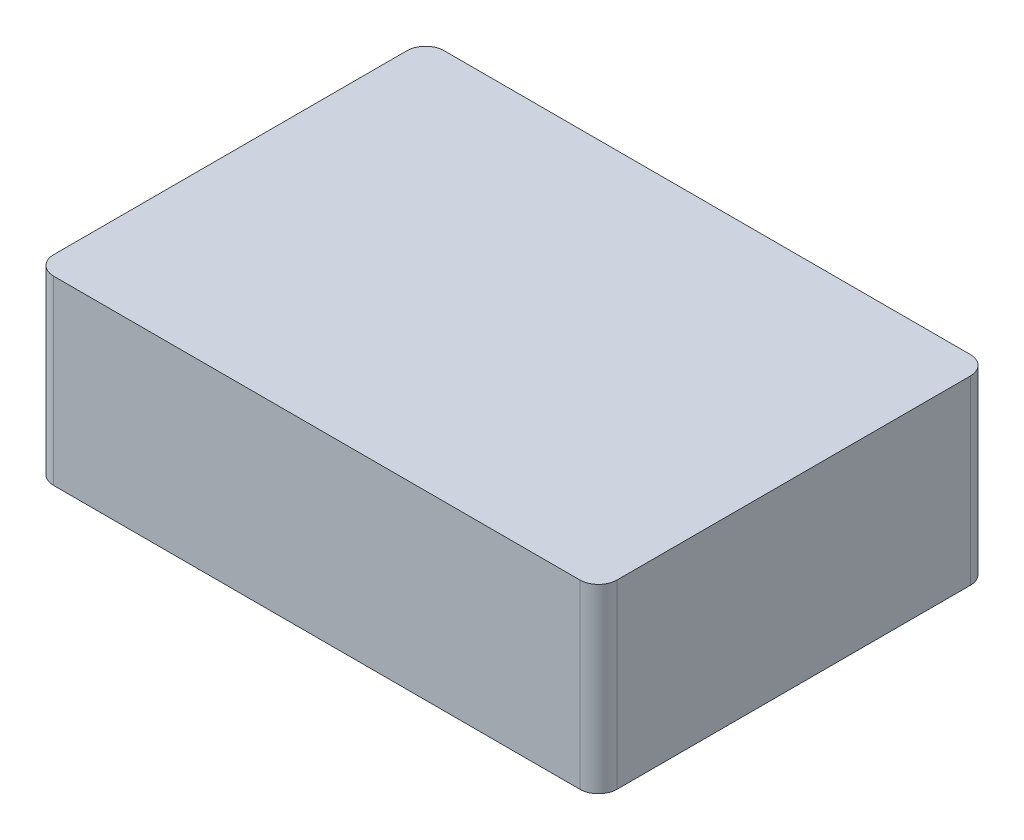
ISO-10303-21;
HEADER;
FILE_DESCRIPTION(('STEP AP214'),'2;1');
FILE_NAME('part.step','',(''),(''),'','','');
FILE_SCHEMA(('AUTOMOTIVE_DESIGN { 1 0 10303 214 1 1 1 1 }'));
ENDSEC;
DATA;
#1=APPLICATION_CONTEXT('core data for automotive mechanical design processes');
#2=APPLICATION_PROTOCOL_DEFINITION('international standard','automotive_design',2000,#1);
#3=PRODUCT_CONTEXT('',#1,'mechanical');
#4=PRODUCT('Part','Part','',(#3));
#5=PRODUCT_RELATED_PRODUCT_CATEGORY('part','',(#4));
#6=PRODUCT_DEFINITION_FORMATION('','',#4);
#7=PRODUCT_DEFINITION_CONTEXT('part definition',#1,'design');
#8=PRODUCT_DEFINITION('design','',#6,#7);
#9=PRODUCT_DEFINITION_SHAPE('','',#8);
#10=(LENGTH_UNIT() NAMED_UNIT(*) SI_UNIT(.MILLI.,.METRE.));
#11=(NAMED_UNIT(*) PLANE_ANGLE_UNIT() SI_UNIT($,.RADIAN.));
#12=(NAMED_UNIT(*) SI_UNIT($,.STERADIAN.) SOLID_ANGLE_UNIT());
#13=UNCERTAINTY_MEASURE_WITH_UNIT(LENGTH_MEASURE(1.E-05),#10,'distance_accuracy_value','');
#14=(GEOMETRIC_REPRESENTATION_CONTEXT(3) GLOBAL_UNCERTAINTY_ASSIGNED_CONTEXT((#13)) GLOBAL_UNIT_ASSIGNED_CONTEXT((#10,
#11,#12)) REPRESENTATION_CONTEXT('',''));
#15=CARTESIAN_POINT('',(0.,0.,0.));
#16=DIRECTION('',(0.,0.,1.));
#17=DIRECTION('',(1.,0.,0.));
#18=AXIS2_PLACEMENT_3D('',#15,#16,#17);
#19=CARTESIAN_POINT('',(38.481,122.214228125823,22.86));
#20=DIRECTION('',(0.,0.,-1.));
#21=DIRECTION('',(-1.,0.,0.));
#22=AXIS2_PLACEMENT_3D('',#19,#20,#21);
#23=PLANE('',#22);
#24=DIRECTION('',(0.,-1.,0.));
#25=VECTOR('',#24,1.);
#26=CARTESIAN_POINT('',(-27.8539034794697,29.9352561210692,22.86));
#27=LINE('',#26,#25);
#28=CARTESIAN_POINT('',(-27.8539034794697,20.955,22.86));
#29=VERTEX_POINT('',#28);
#30=CARTESIAN_POINT('',(-27.8539034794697,0.,22.86));
#31=VERTEX_POINT('',#30);
#32=EDGE_CURVE('E220',#29,#31,#27,.T.);
#33=ORIENTED_EDGE('',*,*,#32,.F.);
#34=DIRECTION('',(-1.,0.,0.));
#35=VECTOR('',#34,1.);
#36=CARTESIAN_POINT('',(38.481,20.955,22.86));
#37=LINE('',#36,#35);
#38=CARTESIAN_POINT('',(27.8539034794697,20.955,22.86));
#39=VERTEX_POINT('',#38);
#40=EDGE_CURVE('E275',#39,#29,#37,.T.);
#41=ORIENTED_EDGE('',*,*,#40,.F.);
#42=DIRECTION('',(0.,-1.,0.));
#43=VECTOR('',#42,1.);
#44=CARTESIAN_POINT('',(27.8539034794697,29.9352561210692,22.86));
#45=LINE('',#44,#43);
#46=CARTESIAN_POINT('',(27.8539034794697,0.,22.86));
#47=VERTEX_POINT('',#46);
#48=EDGE_CURVE('E236',#47,#39,#45,.F.);
#49=ORIENTED_EDGE('',*,*,#48,.F.);
#50=DIRECTION('',(1.,0.,0.));
#51=VECTOR('',#50,1.);
#52=CARTESIAN_POINT('',(38.481,0.,22.86));
#53=LINE('',#52,#51);
#54=EDGE_CURVE('E48',#31,#47,#53,.T.);
#55=ORIENTED_EDGE('',*,*,#54,.F.);
#56=EDGE_LOOP('',(#33,#41,#49,#55));
#57=FACE_BOUND('',#56,.T.);
#58=ADVANCED_FACE('F33',(#57),#23,.T.);
#59=CARTESIAN_POINT('',(38.481,122.214228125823,-22.86));
#60=DIRECTION('',(0.,0.,1.));
#61=DIRECTION('',(1.,0.,0.));
#62=AXIS2_PLACEMENT_3D('',#59,#60,#61);
#63=PLANE('',#62);
#64=DIRECTION('',(0.,-1.,0.));
#65=VECTOR('',#64,1.);
#66=CARTESIAN_POINT('',(-34.1220965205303,29.9352561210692,-22.86));
#67=LINE('',#66,#65);
#68=CARTESIAN_POINT('',(-34.1220965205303,20.955,-22.86));
#69=VERTEX_POINT('',#68);
#70=CARTESIAN_POINT('',(-34.1220965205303,0.,-22.86));
#71=VERTEX_POINT('',#70);
#72=EDGE_CURVE('E230',#69,#71,#67,.T.);
#73=ORIENTED_EDGE('',*,*,#72,.F.);
#74=DIRECTION('',(1.,0.,0.));
#75=VECTOR('',#74,1.);
#76=CARTESIAN_POINT('',(38.481,20.955,-22.86));
#77=LINE('',#76,#75);
#78=CARTESIAN_POINT('',(-34.671,20.955,-22.86));
#79=VERTEX_POINT('',#78);
#80=EDGE_CURVE('E259',#79,#69,#77,.T.);
#81=ORIENTED_EDGE('',*,*,#80,.F.);
#82=DIRECTION('',(0.,1.,0.));
#83=VECTOR('',#82,1.);
#84=CARTESIAN_POINT('',(-34.671,122.214228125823,-22.86));
#85=LINE('',#84,#83);
#86=CARTESIAN_POINT('',(-34.671,0.,-22.86));
#87=VERTEX_POINT('',#86);
#88=EDGE_CURVE('E254',#87,#79,#85,.T.);
#89=ORIENTED_EDGE('',*,*,#88,.F.);
#90=DIRECTION('',(-1.,0.,0.));
#91=VECTOR('',#90,1.);
#92=CARTESIAN_POINT('',(38.481,0.,-22.86));
#93=LINE('',#92,#91);
#94=EDGE_CURVE('E283',#71,#87,#93,.T.);
#95=ORIENTED_EDGE('',*,*,#94,.F.);
#96=EDGE_LOOP('',(#73,#81,#89,#95));
#97=FACE_BOUND('',#96,.T.);
#98=ADVANCED_FACE('F368',(#97),#63,.T.);
#99=DIRECTION('',(0.,-1.,0.));
#100=VECTOR('',#99,1.);
#101=CARTESIAN_POINT('',(34.1220965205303,29.9352561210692,22.86));
#102=LINE('',#101,#100);
#103=CARTESIAN_POINT('',(34.1220965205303,20.955,22.86));
#104=VERTEX_POINT('',#103);
#105=CARTESIAN_POINT('',(34.1220965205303,0.,22.86));
#106=VERTEX_POINT('',#105);
#107=EDGE_CURVE('E239',#104,#106,#102,.T.);
#108=ORIENTED_EDGE('',*,*,#107,.F.);
#109=CARTESIAN_POINT('',(34.671,20.955,22.86));
#110=VERTEX_POINT('',#109);
#111=EDGE_CURVE('E273',#110,#104,#37,.T.);
#112=ORIENTED_EDGE('',*,*,#111,.F.);
#113=DIRECTION('',(0.,1.,0.));
#114=VECTOR('',#113,1.);
#115=CARTESIAN_POINT('',(34.671,122.214228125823,22.86));
#116=LINE('',#115,#114);
#117=CARTESIAN_POINT('',(34.671,0.,22.86));
#118=VERTEX_POINT('',#117);
#119=EDGE_CURVE('E269',#118,#110,#116,.T.);
#120=ORIENTED_EDGE('',*,*,#119,.F.);
#121=EDGE_CURVE('E289',#106,#118,#53,.T.);
#122=ORIENTED_EDGE('',*,*,#121,.F.);
#123=EDGE_LOOP('',(#108,#112,#120,#122));
#124=FACE_BOUND('',#123,.T.);
#125=ADVANCED_FACE('F395',(#124),#23,.T.);
#126=DIRECTION('',(0.,-1.,0.));
#127=VECTOR('',#126,1.);
#128=CARTESIAN_POINT('',(-27.8539034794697,29.9352561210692,-22.86));
#129=LINE('',#128,#127);
#130=CARTESIAN_POINT('',(-27.8539034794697,0.,-22.86));
#131=VERTEX_POINT('',#130);
#132=CARTESIAN_POINT('',(-27.8539034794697,20.955,-22.86));
#133=VERTEX_POINT('',#132);
#134=EDGE_CURVE('E227',#131,#133,#129,.F.);
#135=ORIENTED_EDGE('',*,*,#134,.F.);
#136=CARTESIAN_POINT('',(27.8539034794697,0.,-22.86));
#137=VERTEX_POINT('',#136);
#138=EDGE_CURVE('E282',#137,#131,#93,.T.);
#139=ORIENTED_EDGE('',*,*,#138,.F.);
#140=DIRECTION('',(0.,-1.,0.));
#141=VECTOR('',#140,1.);
#142=CARTESIAN_POINT('',(27.8539034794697,29.9352561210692,-22.86));
#143=LINE('',#142,#141);
#144=CARTESIAN_POINT('',(27.8539034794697,20.955,-22.86));
#145=VERTEX_POINT('',#144);
#146=EDGE_CURVE('E250',#145,#137,#143,.T.);
#147=ORIENTED_EDGE('',*,*,#146,.F.);
#148=EDGE_CURVE('E262',#133,#145,#77,.T.);
#149=ORIENTED_EDGE('',*,*,#148,.F.);
#150=EDGE_LOOP('',(#135,#139,#147,#149));
#151=FACE_BOUND('',#150,.T.);
#152=ADVANCED_FACE('F374',(#151),#63,.T.);
#153=CARTESIAN_POINT('',(0.,0.,0.));
#154=DIRECTION('',(0.,1.,0.));
#155=DIRECTION('',(0.,0.,1.));
#156=AXIS2_PLACEMENT_3D('',#153,#154,#155);
#157=PLANE('',#156);
#158=CARTESIAN_POINT('',(-30.988,0.,22.352));
#159=DIRECTION('',(0.,-1.,0.));
#160=DIRECTION('',(0.,0.,-1.));
#161=AXIS2_PLACEMENT_3D('',#158,#159,#160);
#162=CIRCLE('',#161,1.4732);
#163=CARTESIAN_POINT('',(-30.988,0.,20.8788));
#164=VERTEX_POINT('',#163);
#165=EDGE_CURVE('E194',#164,#164,#162,.T.);
#166=ORIENTED_EDGE('',*,*,#165,.F.);
#167=EDGE_LOOP('',(#166));
#168=FACE_BOUND('',#167,.T.);
#169=CARTESIAN_POINT('',(30.988,0.,22.352));
#170=DIRECTION('',(0.,-1.,0.));
#171=DIRECTION('',(0.,0.,-1.));
#172=AXIS2_PLACEMENT_3D('',#169,#170,#171);
#173=CIRCLE('',#172,1.4732);
#174=CARTESIAN_POINT('',(30.988,0.,20.8788));
#175=VERTEX_POINT('',#174);
#176=EDGE_CURVE('E193',#175,#175,#173,.T.);
#177=ORIENTED_EDGE('',*,*,#176,.F.);
#178=EDGE_LOOP('',(#177));
#179=FACE_BOUND('',#178,.T.);
#180=CARTESIAN_POINT('',(-30.988,0.,-22.352));
#181=DIRECTION('',(0.,-1.,0.));
#182=DIRECTION('',(0.,0.,-1.));
#183=AXIS2_PLACEMENT_3D('',#180,#181,#182);
#184=CIRCLE('',#183,1.4732);
#185=CARTESIAN_POINT('',(-30.988,0.,-23.8252));
#186=VERTEX_POINT('',#185);
#187=EDGE_CURVE('E204',#186,#186,#184,.T.);
#188=ORIENTED_EDGE('',*,*,#187,.F.);
#189=EDGE_LOOP('',(#188));
#190=FACE_BOUND('',#189,.T.);
#191=CARTESIAN_POINT('',(30.988,0.,-22.352));
#192=DIRECTION('',(0.,-1.,0.));
#193=DIRECTION('',(0.,0.,-1.));
#194=AXIS2_PLACEMENT_3D('',#191,#192,#193);
#195=CIRCLE('',#194,1.4732);
#196=CARTESIAN_POINT('',(30.988,0.,-23.8252));
#197=VERTEX_POINT('',#196);
#198=EDGE_CURVE('E210',#197,#197,#195,.T.);
#199=ORIENTED_EDGE('',*,*,#198,.F.);
#200=EDGE_LOOP('',(#199));
#201=FACE_BOUND('',#200,.T.);
#202=CARTESIAN_POINT('',(-34.671,0.,22.86));
#203=VERTEX_POINT('',#202);
#204=CARTESIAN_POINT('',(-34.1220965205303,0.,22.86));
#205=VERTEX_POINT('',#204);
#206=EDGE_CURVE('E287',#203,#205,#53,.T.);
#207=ORIENTED_EDGE('',*,*,#206,.T.);
#208=CARTESIAN_POINT('',(-30.988,0.,22.352));
#209=DIRECTION('',(0.,-1.,0.));
#210=DIRECTION('',(0.,0.,-1.));
#211=AXIS2_PLACEMENT_3D('',#208,#209,#210);
#212=CIRCLE('',#211,3.175);
#213=EDGE_CURVE('E216',#205,#31,#212,.T.);
#214=ORIENTED_EDGE('',*,*,#213,.T.);
#215=ORIENTED_EDGE('',*,*,#54,.T.);
#216=CARTESIAN_POINT('',(30.988,0.,22.352));
#217=DIRECTION('',(0.,-1.,0.));
#218=DIRECTION('',(0.,0.,-1.));
#219=AXIS2_PLACEMENT_3D('',#216,#217,#218);
#220=CIRCLE('',#219,3.175);
#221=EDGE_CURVE('E233',#47,#106,#220,.T.);
#222=ORIENTED_EDGE('',*,*,#221,.T.);
#223=ORIENTED_EDGE('',*,*,#121,.T.);
#224=DIRECTION('',(0.,0.,-1.));
#225=VECTOR('',#224,1.);
#226=CARTESIAN_POINT('',(34.671,0.,26.67));
#227=LINE('',#226,#225);
#228=CARTESIAN_POINT('',(34.671,0.,-22.86));
#229=VERTEX_POINT('',#228);
#230=EDGE_CURVE('E284',#118,#229,#227,.T.);
#231=ORIENTED_EDGE('',*,*,#230,.T.);
#232=CARTESIAN_POINT('',(34.1220965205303,0.,-22.86));
#233=VERTEX_POINT('',#232);
#234=EDGE_CURVE('E279',#229,#233,#93,.T.);
#235=ORIENTED_EDGE('',*,*,#234,.T.);
#236=CARTESIAN_POINT('',(30.988,0.,-22.352));
#237=DIRECTION('',(0.,-1.,0.));
#238=DIRECTION('',(0.,0.,-1.));
#239=AXIS2_PLACEMENT_3D('',#236,#237,#238);
#240=CIRCLE('',#239,3.175);
#241=EDGE_CURVE('E242',#233,#137,#240,.T.);
#242=ORIENTED_EDGE('',*,*,#241,.T.);
#243=ORIENTED_EDGE('',*,*,#138,.T.);
#244=CARTESIAN_POINT('',(-30.988,0.,-22.352));
#245=DIRECTION('',(0.,-1.,0.));
#246=DIRECTION('',(0.,0.,-1.));
#247=AXIS2_PLACEMENT_3D('',#244,#245,#246);
#248=CIRCLE('',#247,3.175);
#249=EDGE_CURVE('E222',#131,#71,#248,.T.);
#250=ORIENTED_EDGE('',*,*,#249,.T.);
#251=ORIENTED_EDGE('',*,*,#94,.T.);
#252=DIRECTION('',(0.,0.,1.));
#253=VECTOR('',#252,1.);
#254=CARTESIAN_POINT('',(-34.671,0.,26.67));
#255=LINE('',#254,#253);
#256=EDGE_CURVE('E253',#87,#203,#255,.T.);
#257=ORIENTED_EDGE('',*,*,#256,.T.);
#258=EDGE_LOOP('',(#207,#214,#215,#222,#223,#231,#235,#242,#243,#250,#251,#257));
#259=FACE_BOUND('',#258,.T.);
#260=DIRECTION('',(1.,0.,0.));
#261=VECTOR('',#260,1.);
#262=CARTESIAN_POINT('',(38.481,0.,26.67));
#263=LINE('',#262,#261);
#264=CARTESIAN_POINT('',(-35.941,0.,26.67));
#265=VERTEX_POINT('',#264);
#266=CARTESIAN_POINT('',(35.941,0.,26.67));
#267=VERTEX_POINT('',#266);
#268=EDGE_CURVE('E305',#265,#267,#263,.T.);
#269=ORIENTED_EDGE('',*,*,#268,.F.);
#270=CARTESIAN_POINT('',(-35.941,0.,24.13));
#271=DIRECTION('',(0.,1.,0.));
#272=DIRECTION('',(0.,0.,1.));
#273=AXIS2_PLACEMENT_3D('',#270,#271,#272);
#274=CIRCLE('',#273,2.54);
#275=CARTESIAN_POINT('',(-38.481,0.,24.13));
#276=VERTEX_POINT('',#275);
#277=EDGE_CURVE('E326',#265,#276,#274,.F.);
#278=ORIENTED_EDGE('',*,*,#277,.T.);
#279=DIRECTION('',(0.,0.,1.));
#280=VECTOR('',#279,1.);
#281=CARTESIAN_POINT('',(-38.481,0.,26.67));
#282=LINE('',#281,#280);
#283=CARTESIAN_POINT('',(-38.481,0.,-24.13));
#284=VERTEX_POINT('',#283);
#285=EDGE_CURVE('E266',#284,#276,#282,.T.);
#286=ORIENTED_EDGE('',*,*,#285,.F.);
#287=CARTESIAN_POINT('',(-35.941,0.,-24.13));
#288=DIRECTION('',(0.,1.,0.));
#289=DIRECTION('',(0.,0.,1.));
#290=AXIS2_PLACEMENT_3D('',#287,#288,#289);
#291=CIRCLE('',#290,2.54);
#292=CARTESIAN_POINT('',(-35.941,0.,-26.67));
#293=VERTEX_POINT('',#292);
#294=EDGE_CURVE('E324',#284,#293,#291,.F.);
#295=ORIENTED_EDGE('',*,*,#294,.T.);
#296=DIRECTION('',(-1.,0.,0.));
#297=VECTOR('',#296,1.);
#298=CARTESIAN_POINT('',(38.481,0.,-26.67));
#299=LINE('',#298,#297);
#300=CARTESIAN_POINT('',(35.941,0.,-26.67));
#301=VERTEX_POINT('',#300);
#302=EDGE_CURVE('E311',#301,#293,#299,.T.);
#303=ORIENTED_EDGE('',*,*,#302,.F.);
#304=CARTESIAN_POINT('',(35.941,0.,-24.13));
#305=DIRECTION('',(0.,1.,0.));
#306=DIRECTION('',(0.,0.,1.));
#307=AXIS2_PLACEMENT_3D('',#304,#305,#306);
#308=CIRCLE('',#307,2.54);
#309=CARTESIAN_POINT('',(38.481,0.,-24.13));
#310=VERTEX_POINT('',#309);
#311=EDGE_CURVE('E322',#301,#310,#308,.F.);
#312=ORIENTED_EDGE('',*,*,#311,.T.);
#313=DIRECTION('',(0.,0.,-1.));
#314=VECTOR('',#313,1.);
#315=CARTESIAN_POINT('',(38.481,0.,26.67));
#316=LINE('',#315,#314);
#317=CARTESIAN_POINT('',(38.481,0.,24.13));
#318=VERTEX_POINT('',#317);
#319=EDGE_CURVE('E308',#318,#310,#316,.T.);
#320=ORIENTED_EDGE('',*,*,#319,.F.);
#321=CARTESIAN_POINT('',(35.941,0.,24.13));
#322=DIRECTION('',(0.,1.,0.));
#323=DIRECTION('',(0.,0.,1.));
#324=AXIS2_PLACEMENT_3D('',#321,#322,#323);
#325=CIRCLE('',#324,2.54);
#326=EDGE_CURVE('E320',#318,#267,#325,.F.);
#327=ORIENTED_EDGE('',*,*,#326,.T.);
#328=EDGE_LOOP('',(#269,#278,#286,#295,#303,#312,#320,#327));
#329=FACE_BOUND('',#328,.T.);
#330=ADVANCED_FACE('F380',(#168,#179,#190,#201,#259,#329),#157,.F.);
#331=CARTESIAN_POINT('',(38.481,122.214228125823,-26.67));
#332=DIRECTION('',(0.,0.,1.));
#333=DIRECTION('',(1.,0.,0.));
#334=AXIS2_PLACEMENT_3D('',#331,#332,#333);
#335=PLANE('',#334);
#336=ORIENTED_EDGE('',*,*,#302,.T.);
#337=DIRECTION('',(0.,-1.,0.));
#338=VECTOR('',#337,1.);
#339=CARTESIAN_POINT('',(-35.941,122.214228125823,-26.67));
#340=LINE('',#339,#338);
#341=CARTESIAN_POINT('',(-35.941,24.765,-26.67));
#342=VERTEX_POINT('',#341);
#343=EDGE_CURVE('E344',#293,#342,#340,.F.);
#344=ORIENTED_EDGE('',*,*,#343,.T.);
#345=DIRECTION('',(1.,0.,0.));
#346=VECTOR('',#345,1.);
#347=CARTESIAN_POINT('',(38.481,24.765,-26.67));
#348=LINE('',#347,#346);
#349=CARTESIAN_POINT('',(35.941,24.765,-26.67));
#350=VERTEX_POINT('',#349);
#351=EDGE_CURVE('E296',#342,#350,#348,.T.);
#352=ORIENTED_EDGE('',*,*,#351,.T.);
#353=DIRECTION('',(0.,-1.,0.));
#354=VECTOR('',#353,1.);
#355=CARTESIAN_POINT('',(35.941,122.214228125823,-26.67));
#356=LINE('',#355,#354);
#357=EDGE_CURVE('E341',#350,#301,#356,.T.);
#358=ORIENTED_EDGE('',*,*,#357,.T.);
#359=EDGE_LOOP('',(#336,#344,#352,#358));
#360=FACE_BOUND('',#359,.T.);
#361=ADVANCED_FACE('F454',(#360),#335,.F.);
#362=CARTESIAN_POINT('',(38.481,122.214228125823,26.67));
#363=DIRECTION('',(-1.,0.,0.));
#364=DIRECTION('',(0.,0.,1.));
#365=AXIS2_PLACEMENT_3D('',#362,#363,#364);
#366=PLANE('',#365);
#367=ORIENTED_EDGE('',*,*,#319,.T.);
#368=DIRECTION('',(0.,-1.,0.));
#369=VECTOR('',#368,1.);
#370=CARTESIAN_POINT('',(38.481,122.214228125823,-24.13));
#371=LINE('',#370,#369);
#372=CARTESIAN_POINT('',(38.481,24.765,-24.13));
#373=VERTEX_POINT('',#372);
#374=EDGE_CURVE('E349',#310,#373,#371,.F.);
#375=ORIENTED_EDGE('',*,*,#374,.T.);
#376=DIRECTION('',(0.,0.,1.));
#377=VECTOR('',#376,1.);
#378=CARTESIAN_POINT('',(38.481,24.765,26.67));
#379=LINE('',#378,#377);
#380=CARTESIAN_POINT('',(38.481,24.765,24.13));
#381=VERTEX_POINT('',#380);
#382=EDGE_CURVE('E292',#373,#381,#379,.T.);
#383=ORIENTED_EDGE('',*,*,#382,.T.);
#384=DIRECTION('',(0.,-1.,0.));
#385=VECTOR('',#384,1.);
#386=CARTESIAN_POINT('',(38.481,122.214228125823,24.13));
#387=LINE('',#386,#385);
#388=EDGE_CURVE('E346',#381,#318,#387,.T.);
#389=ORIENTED_EDGE('',*,*,#388,.T.);
#390=EDGE_LOOP('',(#367,#375,#383,#389));
#391=FACE_BOUND('',#390,.T.);
#392=ADVANCED_FACE('F552',(#391),#366,.F.);
#393=CARTESIAN_POINT('',(38.481,122.214228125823,26.67));
#394=DIRECTION('',(0.,0.,-1.));
#395=DIRECTION('',(-1.,0.,0.));
#396=AXIS2_PLACEMENT_3D('',#393,#394,#395);
#397=PLANE('',#396);
#398=DIRECTION('',(-1.,0.,0.));
#399=VECTOR('',#398,1.);
#400=CARTESIAN_POINT('',(38.481,24.765,26.67));
#401=LINE('',#400,#399);
#402=CARTESIAN_POINT('',(35.941,24.765,26.67));
#403=VERTEX_POINT('',#402);
#404=CARTESIAN_POINT('',(-35.941,24.765,26.67));
#405=VERTEX_POINT('',#404);
#406=EDGE_CURVE('E295',#403,#405,#401,.T.);
#407=ORIENTED_EDGE('',*,*,#406,.T.);
#408=DIRECTION('',(0.,-1.,0.));
#409=VECTOR('',#408,1.);
#410=CARTESIAN_POINT('',(-35.941,122.214228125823,26.67));
#411=LINE('',#410,#409);
#412=EDGE_CURVE('E317',#405,#265,#411,.T.);
#413=ORIENTED_EDGE('',*,*,#412,.T.);
#414=ORIENTED_EDGE('',*,*,#268,.T.);
#415=DIRECTION('',(0.,-1.,0.));
#416=VECTOR('',#415,1.);
#417=CARTESIAN_POINT('',(35.941,122.214228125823,26.67));
#418=LINE('',#417,#416);
#419=EDGE_CURVE('E302',#267,#403,#418,.F.);
#420=ORIENTED_EDGE('',*,*,#419,.T.);
#421=EDGE_LOOP('',(#407,#413,#414,#420));
#422=FACE_BOUND('',#421,.T.);
#423=ADVANCED_FACE('F560',(#422),#397,.F.);
#424=CARTESIAN_POINT('',(-38.481,122.214228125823,26.67));
#425=DIRECTION('',(1.,0.,0.));
#426=DIRECTION('',(0.,0.,-1.));
#427=AXIS2_PLACEMENT_3D('',#424,#425,#426);
#428=PLANE('',#427);
#429=ORIENTED_EDGE('',*,*,#285,.T.);
#430=DIRECTION('',(0.,-1.,0.));
#431=VECTOR('',#430,1.);
#432=CARTESIAN_POINT('',(-38.481,122.214228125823,24.13));
#433=LINE('',#432,#431);
#434=CARTESIAN_POINT('',(-38.481,24.765,24.13));
#435=VERTEX_POINT('',#434);
#436=EDGE_CURVE('E331',#276,#435,#433,.F.);
#437=ORIENTED_EDGE('',*,*,#436,.T.);
#438=DIRECTION('',(0.,0.,-1.));
#439=VECTOR('',#438,1.);
#440=CARTESIAN_POINT('',(-38.481,24.765,26.67));
#441=LINE('',#440,#439);
#442=CARTESIAN_POINT('',(-38.481,24.765,-24.13));
#443=VERTEX_POINT('',#442);
#444=EDGE_CURVE('E299',#435,#443,#441,.T.);
#445=ORIENTED_EDGE('',*,*,#444,.T.);
#446=DIRECTION('',(0.,-1.,0.));
#447=VECTOR('',#446,1.);
#448=CARTESIAN_POINT('',(-38.481,122.214228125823,-24.13));
#449=LINE('',#448,#447);
#450=EDGE_CURVE('E328',#443,#284,#449,.T.);
#451=ORIENTED_EDGE('',*,*,#450,.T.);
#452=EDGE_LOOP('',(#429,#437,#445,#451));
#453=FACE_BOUND('',#452,.T.);
#454=ADVANCED_FACE('F568',(#453),#428,.F.);
#455=CARTESIAN_POINT('',(0.,24.765,0.));
#456=DIRECTION('',(0.,-1.,0.));
#457=DIRECTION('',(-1.,0.,0.));
#458=AXIS2_PLACEMENT_3D('',#455,#456,#457);
#459=PLANE('',#458);
#460=ORIENTED_EDGE('',*,*,#444,.F.);
#461=CARTESIAN_POINT('',(-35.941,24.765,24.13));
#462=DIRECTION('',(0.,-1.,0.));
#463=DIRECTION('',(0.,0.,-1.));
#464=AXIS2_PLACEMENT_3D('',#461,#462,#463);
#465=CIRCLE('',#464,2.54);
#466=EDGE_CURVE('E339',#435,#405,#465,.F.);
#467=ORIENTED_EDGE('',*,*,#466,.T.);
#468=ORIENTED_EDGE('',*,*,#406,.F.);
#469=CARTESIAN_POINT('',(35.941,24.765,24.13));
#470=DIRECTION('',(0.,-1.,0.));
#471=DIRECTION('',(0.,0.,-1.));
#472=AXIS2_PLACEMENT_3D('',#469,#470,#471);
#473=CIRCLE('',#472,2.54);
#474=EDGE_CURVE('E333',#403,#381,#473,.F.);
#475=ORIENTED_EDGE('',*,*,#474,.T.);
#476=ORIENTED_EDGE('',*,*,#382,.F.);
#477=CARTESIAN_POINT('',(35.941,24.765,-24.13));
#478=DIRECTION('',(0.,-1.,0.));
#479=DIRECTION('',(0.,0.,-1.));
#480=AXIS2_PLACEMENT_3D('',#477,#478,#479);
#481=CIRCLE('',#480,2.54);
#482=EDGE_CURVE('E335',#373,#350,#481,.F.);
#483=ORIENTED_EDGE('',*,*,#482,.T.);
#484=ORIENTED_EDGE('',*,*,#351,.F.);
#485=CARTESIAN_POINT('',(-35.941,24.765,-24.13));
#486=DIRECTION('',(0.,-1.,0.));
#487=DIRECTION('',(0.,0.,-1.));
#488=AXIS2_PLACEMENT_3D('',#485,#486,#487);
#489=CIRCLE('',#488,2.54);
#490=EDGE_CURVE('E337',#342,#443,#489,.F.);
#491=ORIENTED_EDGE('',*,*,#490,.T.);
#492=EDGE_LOOP('',(#460,#467,#468,#475,#476,#483,#484,#491));
#493=FACE_BOUND('',#492,.T.);
#494=ADVANCED_FACE('F576',(#493),#459,.F.);
#495=CARTESIAN_POINT('',(-35.941,122.214228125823,24.13));
#496=DIRECTION('',(0.,-1.,0.));
#497=DIRECTION('',(0.,0.,-1.));
#498=AXIS2_PLACEMENT_3D('',#495,#496,#497);
#499=CYLINDRICAL_SURFACE('',#498,2.54);
#500=ORIENTED_EDGE('',*,*,#466,.F.);
#501=ORIENTED_EDGE('',*,*,#436,.F.);
#502=ORIENTED_EDGE('',*,*,#277,.F.);
#503=ORIENTED_EDGE('',*,*,#412,.F.);
#504=EDGE_LOOP('',(#500,#501,#502,#503));
#505=FACE_BOUND('',#504,.T.);
#506=ADVANCED_FACE('F584',(#505),#499,.T.);
#507=CARTESIAN_POINT('',(-35.941,122.214228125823,-24.13));
#508=DIRECTION('',(0.,-1.,0.));
#509=DIRECTION('',(0.,0.,-1.));
#510=AXIS2_PLACEMENT_3D('',#507,#508,#509);
#511=CYLINDRICAL_SURFACE('',#510,2.54);
#512=ORIENTED_EDGE('',*,*,#490,.F.);
#513=ORIENTED_EDGE('',*,*,#343,.F.);
#514=ORIENTED_EDGE('',*,*,#294,.F.);
#515=ORIENTED_EDGE('',*,*,#450,.F.);
#516=EDGE_LOOP('',(#512,#513,#514,#515));
#517=FACE_BOUND('',#516,.T.);
#518=ADVANCED_FACE('F592',(#517),#511,.T.);
#519=CARTESIAN_POINT('',(35.941,122.214228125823,-24.13));
#520=DIRECTION('',(0.,-1.,0.));
#521=DIRECTION('',(0.,0.,-1.));
#522=AXIS2_PLACEMENT_3D('',#519,#520,#521);
#523=CYLINDRICAL_SURFACE('',#522,2.54);
#524=ORIENTED_EDGE('',*,*,#482,.F.);
#525=ORIENTED_EDGE('',*,*,#374,.F.);
#526=ORIENTED_EDGE('',*,*,#311,.F.);
#527=ORIENTED_EDGE('',*,*,#357,.F.);
#528=EDGE_LOOP('',(#524,#525,#526,#527));
#529=FACE_BOUND('',#528,.T.);
#530=ADVANCED_FACE('F600',(#529),#523,.T.);
#531=CARTESIAN_POINT('',(35.941,122.214228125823,24.13));
#532=DIRECTION('',(0.,-1.,0.));
#533=DIRECTION('',(0.,0.,-1.));
#534=AXIS2_PLACEMENT_3D('',#531,#532,#533);
#535=CYLINDRICAL_SURFACE('',#534,2.54);
#536=ORIENTED_EDGE('',*,*,#474,.F.);
#537=ORIENTED_EDGE('',*,*,#419,.F.);
#538=ORIENTED_EDGE('',*,*,#326,.F.);
#539=ORIENTED_EDGE('',*,*,#388,.F.);
#540=EDGE_LOOP('',(#536,#537,#538,#539));
#541=FACE_BOUND('',#540,.T.);
#542=ADVANCED_FACE('F35',(#541),#535,.T.);
#543=DIRECTION('',(0.,-1.,0.));
#544=VECTOR('',#543,1.);
#545=CARTESIAN_POINT('',(34.1220965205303,29.9352561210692,-22.86));
#546=LINE('',#545,#544);
#547=CARTESIAN_POINT('',(34.1220965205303,20.955,-22.86));
#548=VERTEX_POINT('',#547);
#549=EDGE_CURVE('E247',#233,#548,#546,.F.);
#550=ORIENTED_EDGE('',*,*,#549,.F.);
#551=ORIENTED_EDGE('',*,*,#234,.F.);
#552=DIRECTION('',(0.,1.,0.));
#553=VECTOR('',#552,1.);
#554=CARTESIAN_POINT('',(34.671,122.214228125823,-22.86));
#555=LINE('',#554,#553);
#556=CARTESIAN_POINT('',(34.671,20.955,-22.86));
#557=VERTEX_POINT('',#556);
#558=EDGE_CURVE('E257',#229,#557,#555,.T.);
#559=ORIENTED_EDGE('',*,*,#558,.T.);
#560=EDGE_CURVE('E263',#548,#557,#77,.T.);
#561=ORIENTED_EDGE('',*,*,#560,.F.);
#562=EDGE_LOOP('',(#550,#551,#559,#561));
#563=FACE_BOUND('',#562,.T.);
#564=ADVANCED_FACE('F387',(#563),#63,.T.);
#565=CARTESIAN_POINT('',(34.671,122.214228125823,26.67));
#566=DIRECTION('',(-1.,0.,0.));
#567=DIRECTION('',(0.,0.,1.));
#568=AXIS2_PLACEMENT_3D('',#565,#566,#567);
#569=PLANE('',#568);
#570=ORIENTED_EDGE('',*,*,#230,.F.);
#571=ORIENTED_EDGE('',*,*,#119,.T.);
#572=DIRECTION('',(0.,0.,1.));
#573=VECTOR('',#572,1.);
#574=CARTESIAN_POINT('',(34.671,20.955,26.67));
#575=LINE('',#574,#573);
#576=EDGE_CURVE('E261',#557,#110,#575,.T.);
#577=ORIENTED_EDGE('',*,*,#576,.F.);
#578=ORIENTED_EDGE('',*,*,#558,.F.);
#579=EDGE_LOOP('',(#570,#571,#577,#578));
#580=FACE_BOUND('',#579,.T.);
#581=ADVANCED_FACE('F392',(#580),#569,.T.);
#582=DIRECTION('',(0.,-1.,0.));
#583=VECTOR('',#582,1.);
#584=CARTESIAN_POINT('',(-34.1220965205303,29.9352561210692,22.86));
#585=LINE('',#584,#583);
#586=CARTESIAN_POINT('',(-34.1220965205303,20.955,22.86));
#587=VERTEX_POINT('',#586);
#588=EDGE_CURVE('E56',#205,#587,#585,.F.);
#589=ORIENTED_EDGE('',*,*,#588,.F.);
#590=ORIENTED_EDGE('',*,*,#206,.F.);
#591=DIRECTION('',(0.,1.,0.));
#592=VECTOR('',#591,1.);
#593=CARTESIAN_POINT('',(-34.671,122.214228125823,22.86));
#594=LINE('',#593,#592);
#595=CARTESIAN_POINT('',(-34.671,20.955,22.86));
#596=VERTEX_POINT('',#595);
#597=EDGE_CURVE('E258',#203,#596,#594,.T.);
#598=ORIENTED_EDGE('',*,*,#597,.T.);
#599=EDGE_CURVE('E268',#587,#596,#37,.T.);
#600=ORIENTED_EDGE('',*,*,#599,.F.);
#601=EDGE_LOOP('',(#589,#590,#598,#600));
#602=FACE_BOUND('',#601,.T.);
#603=ADVANCED_FACE('F360',(#602),#23,.T.);
#604=CARTESIAN_POINT('',(-34.671,122.214228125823,26.67));
#605=DIRECTION('',(1.,0.,0.));
#606=DIRECTION('',(0.,0.,-1.));
#607=AXIS2_PLACEMENT_3D('',#604,#605,#606);
#608=PLANE('',#607);
#609=ORIENTED_EDGE('',*,*,#256,.F.);
#610=ORIENTED_EDGE('',*,*,#88,.T.);
#611=DIRECTION('',(0.,0.,-1.));
#612=VECTOR('',#611,1.);
#613=CARTESIAN_POINT('',(-34.671,20.955,26.67));
#614=LINE('',#613,#612);
#615=EDGE_CURVE('E272',#596,#79,#614,.T.);
#616=ORIENTED_EDGE('',*,*,#615,.F.);
#617=ORIENTED_EDGE('',*,*,#597,.F.);
#618=EDGE_LOOP('',(#609,#610,#616,#617));
#619=FACE_BOUND('',#618,.T.);
#620=ADVANCED_FACE('F363',(#619),#608,.T.);
#621=CARTESIAN_POINT('',(0.,20.955,0.));
#622=DIRECTION('',(0.,-1.,0.));
#623=DIRECTION('',(-1.,0.,0.));
#624=AXIS2_PLACEMENT_3D('',#621,#622,#623);
#625=PLANE('',#624);
#626=CARTESIAN_POINT('',(-30.988,20.955,22.352));
#627=DIRECTION('',(0.,-1.,0.));
#628=DIRECTION('',(0.,0.,-1.));
#629=AXIS2_PLACEMENT_3D('',#626,#627,#628);
#630=CIRCLE('',#629,3.175);
#631=EDGE_CURVE('E11',#587,#29,#630,.T.);
#632=ORIENTED_EDGE('',*,*,#631,.F.);
#633=ORIENTED_EDGE('',*,*,#599,.T.);
#634=ORIENTED_EDGE('',*,*,#615,.T.);
#635=ORIENTED_EDGE('',*,*,#80,.T.);
#636=CARTESIAN_POINT('',(-30.988,20.955,-22.352));
#637=DIRECTION('',(0.,-1.,0.));
#638=DIRECTION('',(0.,0.,-1.));
#639=AXIS2_PLACEMENT_3D('',#636,#637,#638);
#640=CIRCLE('',#639,3.175);
#641=EDGE_CURVE('E225',#69,#133,#640,.F.);
#642=ORIENTED_EDGE('',*,*,#641,.T.);
#643=ORIENTED_EDGE('',*,*,#148,.T.);
#644=CARTESIAN_POINT('',(30.988,20.955,-22.352));
#645=DIRECTION('',(0.,-1.,0.));
#646=DIRECTION('',(0.,0.,-1.));
#647=AXIS2_PLACEMENT_3D('',#644,#645,#646);
#648=CIRCLE('',#647,3.175);
#649=EDGE_CURVE('E245',#145,#548,#648,.F.);
#650=ORIENTED_EDGE('',*,*,#649,.T.);
#651=ORIENTED_EDGE('',*,*,#560,.T.);
#652=ORIENTED_EDGE('',*,*,#576,.T.);
#653=ORIENTED_EDGE('',*,*,#111,.T.);
#654=CARTESIAN_POINT('',(30.988,20.955,22.352));
#655=DIRECTION('',(0.,-1.,0.));
#656=DIRECTION('',(0.,0.,-1.));
#657=AXIS2_PLACEMENT_3D('',#654,#655,#656);
#658=CIRCLE('',#657,3.175);
#659=EDGE_CURVE('E41',#39,#104,#658,.T.);
#660=ORIENTED_EDGE('',*,*,#659,.F.);
#661=ORIENTED_EDGE('',*,*,#40,.T.);
#662=EDGE_LOOP('',(#632,#633,#634,#635,#642,#643,#650,#651,#652,#653,#660,#661));
#663=FACE_BOUND('',#662,.T.);
#664=ADVANCED_FACE('F357',(#663),#625,.T.);
#665=CARTESIAN_POINT('',(30.988,29.9352561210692,-22.352));
#666=DIRECTION('',(0.,-1.,0.));
#667=DIRECTION('',(0.,0.,-1.));
#668=AXIS2_PLACEMENT_3D('',#665,#666,#667);
#669=CYLINDRICAL_SURFACE('',#668,3.175);
#670=ORIENTED_EDGE('',*,*,#649,.F.);
#671=ORIENTED_EDGE('',*,*,#146,.T.);
#672=ORIENTED_EDGE('',*,*,#241,.F.);
#673=ORIENTED_EDGE('',*,*,#549,.T.);
#674=EDGE_LOOP('',(#670,#671,#672,#673));
#675=FACE_BOUND('',#674,.T.);
#676=ADVANCED_FACE('F384',(#675),#669,.T.);
#677=CARTESIAN_POINT('',(30.988,29.9352561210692,22.352));
#678=DIRECTION('',(0.,-1.,0.));
#679=DIRECTION('',(0.,0.,-1.));
#680=AXIS2_PLACEMENT_3D('',#677,#678,#679);
#681=CYLINDRICAL_SURFACE('',#680,3.175);
#682=ORIENTED_EDGE('',*,*,#659,.T.);
#683=ORIENTED_EDGE('',*,*,#107,.T.);
#684=ORIENTED_EDGE('',*,*,#221,.F.);
#685=ORIENTED_EDGE('',*,*,#48,.T.);
#686=EDGE_LOOP('',(#682,#683,#684,#685));
#687=FACE_BOUND('',#686,.T.);
#688=ADVANCED_FACE('F352',(#687),#681,.T.);
#689=CARTESIAN_POINT('',(-30.988,29.9352561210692,-22.352));
#690=DIRECTION('',(0.,-1.,0.));
#691=DIRECTION('',(0.,0.,-1.));
#692=AXIS2_PLACEMENT_3D('',#689,#690,#691);
#693=CYLINDRICAL_SURFACE('',#692,3.175);
#694=ORIENTED_EDGE('',*,*,#641,.F.);
#695=ORIENTED_EDGE('',*,*,#72,.T.);
#696=ORIENTED_EDGE('',*,*,#249,.F.);
#697=ORIENTED_EDGE('',*,*,#134,.T.);
#698=EDGE_LOOP('',(#694,#695,#696,#697));
#699=FACE_BOUND('',#698,.T.);
#700=ADVANCED_FACE('F378',(#699),#693,.T.);
#701=CARTESIAN_POINT('',(-30.988,29.9352561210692,22.352));
#702=DIRECTION('',(0.,-1.,0.));
#703=DIRECTION('',(0.,0.,-1.));
#704=AXIS2_PLACEMENT_3D('',#701,#702,#703);
#705=CYLINDRICAL_SURFACE('',#704,3.175);
#706=ORIENTED_EDGE('',*,*,#631,.T.);
#707=ORIENTED_EDGE('',*,*,#32,.T.);
#708=ORIENTED_EDGE('',*,*,#213,.F.);
#709=ORIENTED_EDGE('',*,*,#588,.T.);
#710=EDGE_LOOP('',(#706,#707,#708,#709));
#711=FACE_BOUND('',#710,.T.);
#712=ADVANCED_FACE('F398',(#711),#705,.T.);
#713=CARTESIAN_POINT('',(30.988,7.62,-22.352));
#714=DIRECTION('',(0.,-1.,0.));
#715=DIRECTION('',(0.,0.,-1.));
#716=AXIS2_PLACEMENT_3D('',#713,#714,#715);
#717=CONICAL_SURFACE('',#716,1.4732,1.02974425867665);
#718=CARTESIAN_POINT('',(30.988,8.5051878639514,-22.352));
#719=VERTEX_POINT('',#718);
#720=VERTEX_LOOP('',#719);
#721=FACE_BOUND('',#720,.T.);
#722=CARTESIAN_POINT('',(30.988,7.62,-22.352));
#723=DIRECTION('',(0.,-1.,0.));
#724=DIRECTION('',(0.,0.,-1.));
#725=AXIS2_PLACEMENT_3D('',#722,#723,#724);
#726=CIRCLE('',#725,1.4732);
#727=CARTESIAN_POINT('',(30.988,7.62,-23.8252));
#728=VERTEX_POINT('',#727);
#729=EDGE_CURVE('E213',#728,#728,#726,.T.);
#730=ORIENTED_EDGE('',*,*,#729,.T.);
#731=EDGE_LOOP('',(#730));
#732=FACE_BOUND('',#731,.T.);
#733=ADVANCED_FACE('F400',(#721,#732),#717,.F.);
#734=CARTESIAN_POINT('',(30.988,0.,-22.352));
#735=DIRECTION('',(0.,-1.,0.));
#736=DIRECTION('',(0.,0.,-1.));
#737=AXIS2_PLACEMENT_3D('',#734,#735,#736);
#738=CYLINDRICAL_SURFACE('',#737,1.4732);
#739=ORIENTED_EDGE('',*,*,#729,.F.);
#740=EDGE_LOOP('',(#739));
#741=FACE_BOUND('',#740,.T.);
#742=ORIENTED_EDGE('',*,*,#198,.T.);
#743=EDGE_LOOP('',(#742));
#744=FACE_BOUND('',#743,.T.);
#745=ADVANCED_FACE('F406',(#741,#744),#738,.F.);
#746=CARTESIAN_POINT('',(-30.988,7.62,-22.352));
#747=DIRECTION('',(0.,-1.,0.));
#748=DIRECTION('',(0.,0.,-1.));
#749=AXIS2_PLACEMENT_3D('',#746,#747,#748);
#750=CONICAL_SURFACE('',#749,1.4732,1.02974425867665);
#751=CARTESIAN_POINT('',(-30.988,8.5051878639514,-22.352));
#752=VERTEX_POINT('',#751);
#753=VERTEX_LOOP('',#752);
#754=FACE_BOUND('',#753,.T.);
#755=CARTESIAN_POINT('',(-30.988,7.62,-22.352));
#756=DIRECTION('',(0.,-1.,0.));
#757=DIRECTION('',(0.,0.,-1.));
#758=AXIS2_PLACEMENT_3D('',#755,#756,#757);
#759=CIRCLE('',#758,1.4732);
#760=CARTESIAN_POINT('',(-30.988,7.62,-23.8252));
#761=VERTEX_POINT('',#760);
#762=EDGE_CURVE('E207',#761,#761,#759,.T.);
#763=ORIENTED_EDGE('',*,*,#762,.T.);
#764=EDGE_LOOP('',(#763));
#765=FACE_BOUND('',#764,.T.);
#766=ADVANCED_FACE('F473',(#754,#765),#750,.F.);
#767=CARTESIAN_POINT('',(-30.988,0.,-22.352));
#768=DIRECTION('',(0.,-1.,0.));
#769=DIRECTION('',(0.,0.,-1.));
#770=AXIS2_PLACEMENT_3D('',#767,#768,#769);
#771=CYLINDRICAL_SURFACE('',#770,1.4732);
#772=ORIENTED_EDGE('',*,*,#762,.F.);
#773=EDGE_LOOP('',(#772));
#774=FACE_BOUND('',#773,.T.);
#775=ORIENTED_EDGE('',*,*,#187,.T.);
#776=EDGE_LOOP('',(#775));
#777=FACE_BOUND('',#776,.T.);
#778=ADVANCED_FACE('F483',(#774,#777),#771,.F.);
#779=CARTESIAN_POINT('',(30.988,7.62,22.352));
#780=DIRECTION('',(0.,-1.,0.));
#781=DIRECTION('',(0.,0.,-1.));
#782=AXIS2_PLACEMENT_3D('',#779,#780,#781);
#783=CONICAL_SURFACE('',#782,1.4732,1.02974425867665);
#784=CARTESIAN_POINT('',(30.988,8.5051878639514,22.352));
#785=VERTEX_POINT('',#784);
#786=VERTEX_LOOP('',#785);
#787=FACE_BOUND('',#786,.T.);
#788=CARTESIAN_POINT('',(30.988,7.62,22.352));
#789=DIRECTION('',(0.,-1.,0.));
#790=DIRECTION('',(0.,0.,-1.));
#791=AXIS2_PLACEMENT_3D('',#788,#789,#790);
#792=CIRCLE('',#791,1.4732);
#793=CARTESIAN_POINT('',(30.988,7.62,20.8788));
#794=VERTEX_POINT('',#793);
#795=EDGE_CURVE('E197',#794,#794,#792,.T.);
#796=ORIENTED_EDGE('',*,*,#795,.T.);
#797=EDGE_LOOP('',(#796));
#798=FACE_BOUND('',#797,.T.);
#799=ADVANCED_FACE('F493',(#787,#798),#783,.F.);
#800=CARTESIAN_POINT('',(30.988,0.,22.352));
#801=DIRECTION('',(0.,-1.,0.));
#802=DIRECTION('',(0.,0.,-1.));
#803=AXIS2_PLACEMENT_3D('',#800,#801,#802);
#804=CYLINDRICAL_SURFACE('',#803,1.4732);
#805=ORIENTED_EDGE('',*,*,#795,.F.);
#806=EDGE_LOOP('',(#805));
#807=FACE_BOUND('',#806,.T.);
#808=ORIENTED_EDGE('',*,*,#176,.T.);
#809=EDGE_LOOP('',(#808));
#810=FACE_BOUND('',#809,.T.);
#811=ADVANCED_FACE('F187',(#807,#810),#804,.F.);
#812=CARTESIAN_POINT('',(-30.988,7.62,22.352));
#813=DIRECTION('',(0.,-1.,0.));
#814=DIRECTION('',(0.,0.,-1.));
#815=AXIS2_PLACEMENT_3D('',#812,#813,#814);
#816=CONICAL_SURFACE('',#815,1.4732,1.02974425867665);
#817=CARTESIAN_POINT('',(-30.988,8.5051878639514,22.352));
#818=VERTEX_POINT('',#817);
#819=VERTEX_LOOP('',#818);
#820=FACE_BOUND('',#819,.T.);
#821=CARTESIAN_POINT('',(-30.988,7.62,22.352));
#822=DIRECTION('',(0.,-1.,0.));
#823=DIRECTION('',(0.,0.,-1.));
#824=AXIS2_PLACEMENT_3D('',#821,#822,#823);
#825=CIRCLE('',#824,1.4732);
#826=CARTESIAN_POINT('',(-30.988,7.62,20.8788));
#827=VERTEX_POINT('',#826);
#828=EDGE_CURVE('E191',#827,#827,#825,.T.);
#829=ORIENTED_EDGE('',*,*,#828,.T.);
#830=EDGE_LOOP('',(#829));
#831=FACE_BOUND('',#830,.T.);
#832=ADVANCED_FACE('F183',(#820,#831),#816,.F.);
#833=CARTESIAN_POINT('',(-30.988,0.,22.352));
#834=DIRECTION('',(0.,-1.,0.));
#835=DIRECTION('',(0.,0.,-1.));
#836=AXIS2_PLACEMENT_3D('',#833,#834,#835);
#837=CYLINDRICAL_SURFACE('',#836,1.4732);
#838=ORIENTED_EDGE('',*,*,#828,.F.);
#839=EDGE_LOOP('',(#838));
#840=FACE_BOUND('',#839,.T.);
#841=ORIENTED_EDGE('',*,*,#165,.T.);
#842=EDGE_LOOP('',(#841));
#843=FACE_BOUND('',#842,.T.);
#844=ADVANCED_FACE('F186',(#840,#843),#837,.F.);
#845=CLOSED_SHELL('',(#58,#98,#125,#152,#330,#361,#392,#423,#454,#494,#506,#518,#530,#542,#564,
#581,#603,#620,#664,#676,#688,#700,#712,#733,#745,#766,#778,#799,#811,#832,#844));
#846=MANIFOLD_SOLID_BREP('B2',#845);
#847=ADVANCED_BREP_SHAPE_REPRESENTATION('',(#18,#846),#14);
#848=SHAPE_DEFINITION_REPRESENTATION(#9,#847);
ENDSEC;
END-ISO-10303-21;
